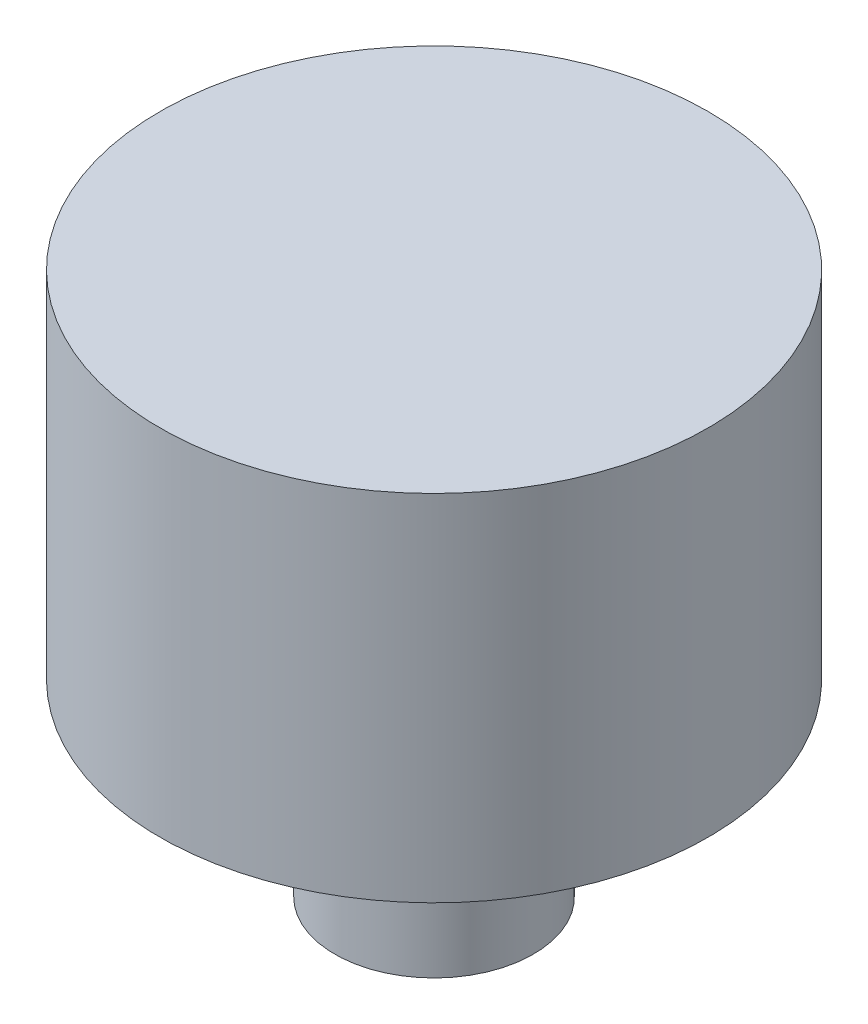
from build123d import *

# Parameters (mm, degrees)
SKETCH1_R           = 27.6
BOSS_EXTRUDE1_DEPTH = 17.85
SKETCH2_R           = 10
BOSS_EXTRUDE2_DEPTH = 19


with BuildPart() as part:
    # Sketch1 → Boss-Extrude1 (new, symmetric)
    with BuildSketch(Plane(origin=(0, 0, 0), x_dir=(1, 0, 0), z_dir=(0, 1, 0))):
        with Locations(Location((0, 0, 0), (0, 0, 90))):
            Circle(SKETCH1_R)
    extrude(amount=BOSS_EXTRUDE1_DEPTH, both=True)

    # Sketch2 → Boss-Extrude2 (add)
    with BuildSketch(Plane.XZ.offset(17.85)):
        with Locations(Location((0, 0, 0), (0, 0, 270))):
            Circle(SKETCH2_R)
    extrude(amount=BOSS_EXTRUDE2_DEPTH)


solid = part.part
